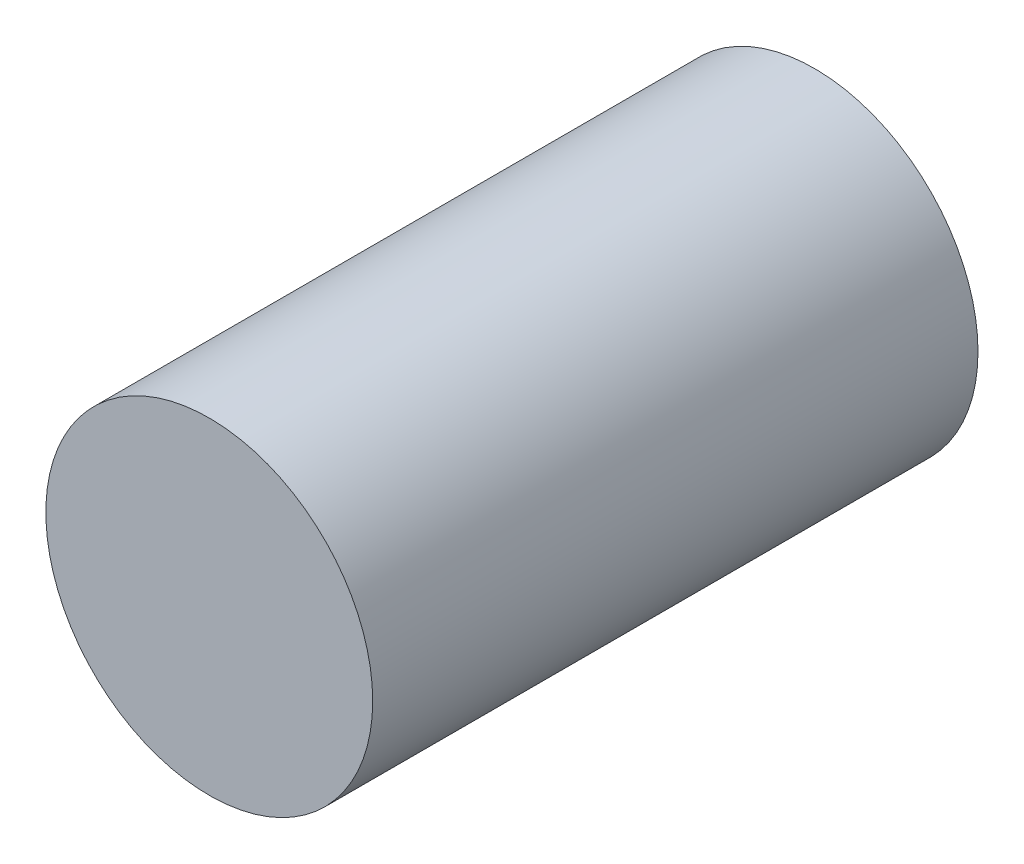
from build123d import *

# Parameters (mm, degrees)
SCHIZZO1_R                   = 13.5
ESTRUSIONE_ESTRUSIONE1_DEPTH = 50


with BuildPart() as part:
    # Schizzo1 → Estrusione-Estrusione1 (new body)
    with BuildSketch(Plane.XY):
        Circle(SCHIZZO1_R)
    extrude(amount=ESTRUSIONE_ESTRUSIONE1_DEPTH)


solid = part.part
